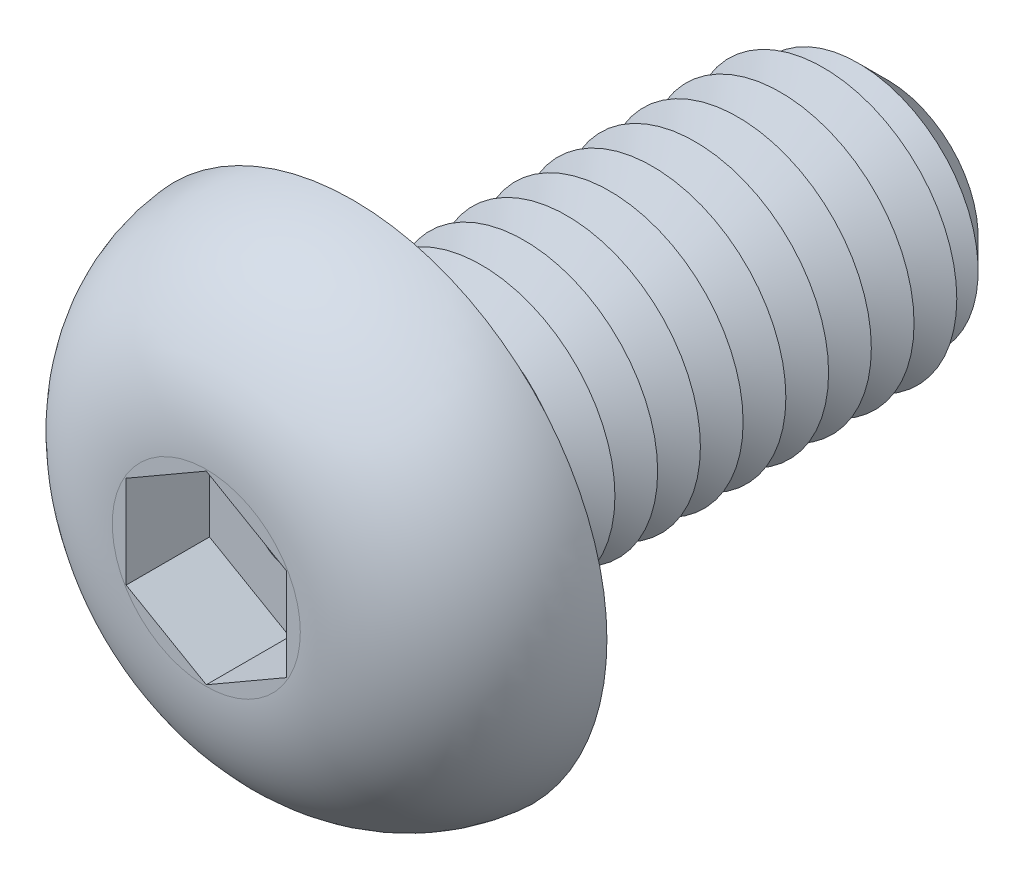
from build123d import *

# Parameters (mm, degrees)
CUT_EXTRUDE1_DEPTH  = 1.56
SKETCH4_R           = 2.5
BOSS_EXTRUDE1_DEPTH = 10
CHAMFER1_SIZE       = 0.8
LPATTERN1_COUNT     = 11
LPATTERN1_PITCH     = 0.8
FILLET2_R           = 0.4
SKETCH6_R           = 0.65
CUT_EXTRUDE2_DEPTH  = 11.19


with BuildPart() as part:
    # Sketch2 → Revolve1 (revolve)
    with BuildSketch(Plane(origin=(0, 0, 0), x_dir=(0, 0, -1), z_dir=(1, 0, 0)), mode=Mode.PRIVATE) as revolve1_sk:
        with BuildLine():
            Line((0, 0), (-2.75, 0))
            Line((-2.75, 0), (-2.75, 1.760434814))
            ThreePointArc((-2.75, 1.760434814), (-1.957940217, 3.791444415), (0, 4.75))
            Line((0, 4.75), (0, 0))
        make_face()
    revolve(revolve1_sk.sketch.rotate(Axis((0, 0, 47.934239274), (0, 0, -1)), 90), axis=Axis((0, 0, 47.934239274), (0, 0, -1)))

    # Sketch3 → Cut-Extrude1 (cut)
    with BuildSketch(Plane.XY.offset(2.75)):
        Polygon((0, 1.732050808), (-1.5, 0.866025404), (-1.5, -0.866025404), (0, -1.732050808), (1.5, -0.866025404), (1.5, 0.866025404), align=None)
    extrude(amount=-CUT_EXTRUDE1_DEPTH, mode=Mode.SUBTRACT)

    # Sketch4 → Boss-Extrude1 (add)
    with BuildSketch(Plane(origin=(0, 0, 0), x_dir=(-1, 0, 0), z_dir=(0, 0, -1))):
        with Locations(Location((0, 0, 0), (0, 0, 180))):
            Circle(SKETCH4_R)
    extrude(amount=BOSS_EXTRUDE1_DEPTH)

    # Chamfer1
    chamfer1_edges = [part.edges().sort_by_distance(p)[0] for p in [
        (-2.5, 0, -10),
    ]]
    chamfer(chamfer1_edges, length=CHAMFER1_SIZE)

    # Sketch5 → Cut-Revolve1 (revolve, cut)
    with BuildSketch(Plane(origin=(0, 0, 0), x_dir=(0, 0, -1), z_dir=(1, 0, 0)), mode=Mode.PRIVATE) as cut_revolve1_sk:
        Polygon((0.8, 2.5), (1.6, 2.5), (1.2, 1.807179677), align=None)
    cut_revolve1 = revolve(cut_revolve1_sk.sketch.rotate(Axis((0, 0, 47.934239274), (0, 0, -1)), 90), axis=Axis((0, 0, 47.934239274), (0, 0, -1)), mode=Mode.SUBTRACT)

    # LPattern1: Cut-Revolve1 ×11
    with Locations(*[(0, 0, -i * LPATTERN1_PITCH) for i in range(1, LPATTERN1_COUNT)]):
        add(cut_revolve1, mode=Mode.SUBTRACT)

    # Fillet2
    fillet2_edges = [part.edges().sort_by_distance(p)[0] for p in [
        (-2.5, 0, 0),
    ]]
    fillet(fillet2_edges, radius=FILLET2_R)

    # Sketch6 → Cut-Extrude2 (cut)
    with BuildSketch(Plane.XY.offset(1.19)):
        Circle(SKETCH6_R)
    extrude(amount=-CUT_EXTRUDE2_DEPTH, mode=Mode.SUBTRACT)


solid = part.part
